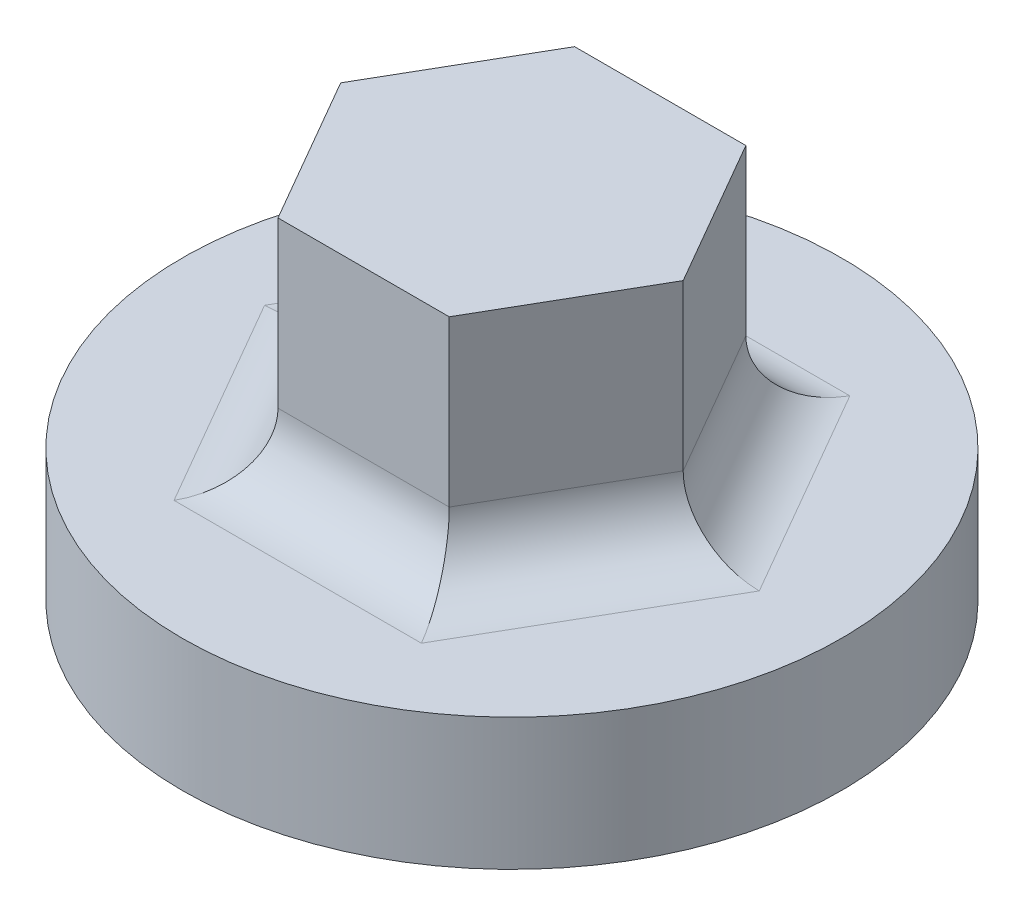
from build123d import *

# Parameters (mm, degrees)
SKETCH1_R      = 50
EXTRUDE1_DEPTH = 20
EXTRUDE2_DEPTH = 35
FILLET3_R      = 10


with BuildPart() as part:
    # Sketch1 → Extrude1 (new body)
    with BuildSketch(Plane(origin=(0, 0, 0), x_dir=(1, 0, 0), z_dir=(0, 1, 0))):
        with Locations(Location((0, 0, 0), (0, 0, 270))):
            Circle(SKETCH1_R)
    extrude(amount=EXTRUDE1_DEPTH)

    # Sketch2 → Extrude2 (add)
    with BuildSketch(Plane(origin=(0, 20, 0), x_dir=(-1, 0, 0), z_dir=(0, 1, 0))):
        Polygon((25.980762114, 0), (12.990381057, 22.5), (-12.990381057, 22.5), (-25.980762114, 0), (-12.990381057, -22.5), (12.990381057, -22.5), align=None)
    extrude(amount=EXTRUDE2_DEPTH)

    # Fillet3
    fillet3_edges = [part.edges().sort_by_distance(p)[0] for p in [
        (0, 20, -22.5),
        (-19.485571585, 20, -11.25),
        (-19.485571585, 20, 11.25),
        (0, 20, 22.5),
        (19.485571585, 20, 11.25),
        (19.485571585, 20, -11.25),
    ]]
    fillet(fillet3_edges, radius=FILLET3_R)


solid = part.part
